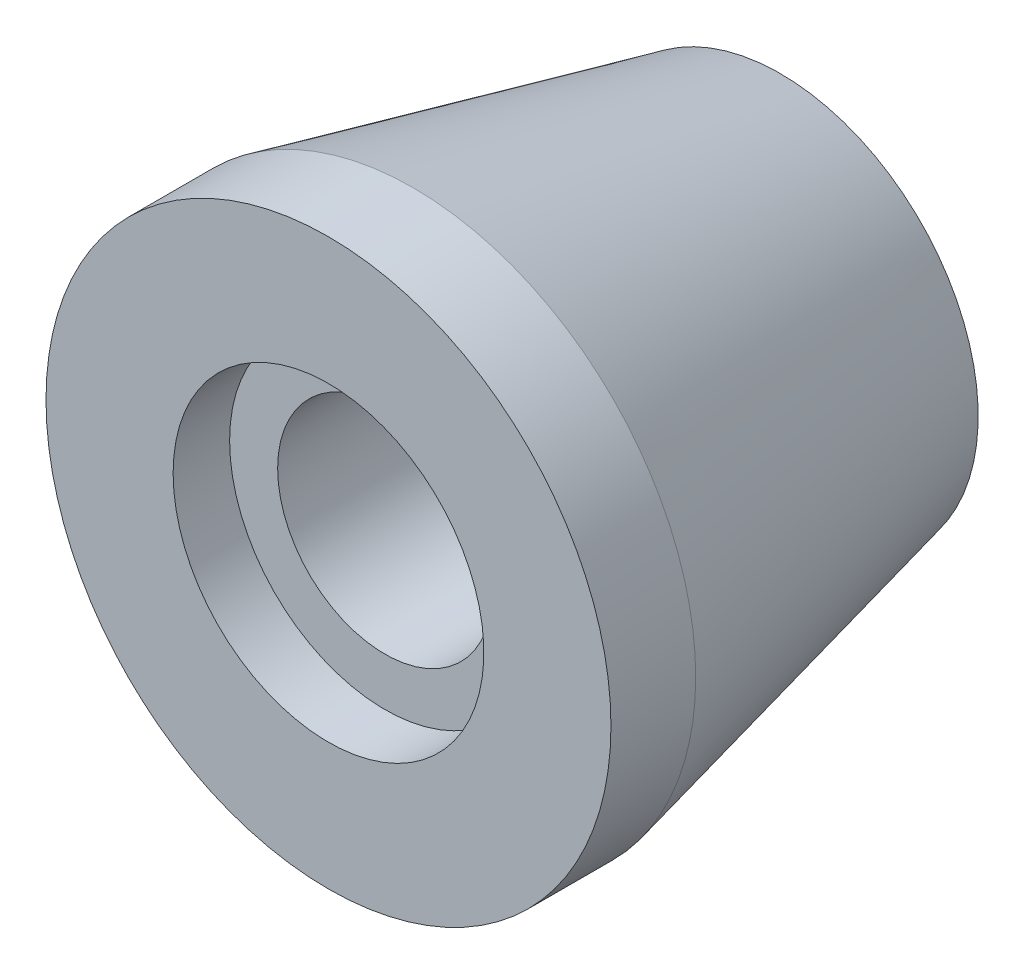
from build123d import *


with BuildPart() as part:
    # Sketch3 → Revolve1 (revolve)
    with BuildSketch(Plane(origin=(0, 0, 0), x_dir=(0, 0, -1), z_dir=(1, 0, 0)), mode=Mode.PRIVATE) as revolve1_sk:
        Polygon((0, 7), (0, 3.8), (-14, 3.8), (-14, 5.5), (-16, 5.5), (-16, 10), (-13, 10), align=None)
    revolve(revolve1_sk.sketch.rotate(Axis((0, 0, 0), (0, 0, 1)), 90), axis=Axis((0, 0, 0), (0, 0, 1)))


solid = part.part
